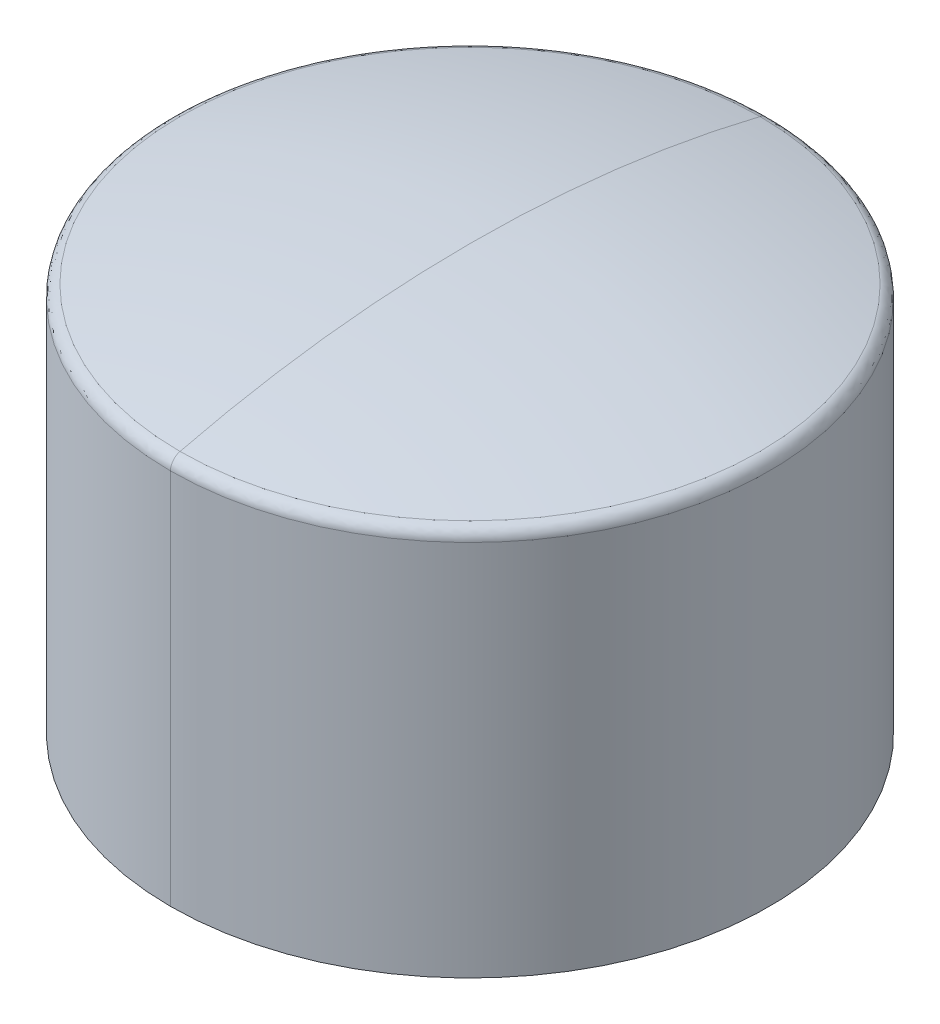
ISO-10303-21;
HEADER;
FILE_DESCRIPTION(('STEP AP214'),'2;1');
FILE_NAME('part.step','',(''),(''),'','','');
FILE_SCHEMA(('AUTOMOTIVE_DESIGN { 1 0 10303 214 1 1 1 1 }'));
ENDSEC;
DATA;
#1=APPLICATION_CONTEXT('core data for automotive mechanical design processes');
#2=APPLICATION_PROTOCOL_DEFINITION('international standard','automotive_design',2000,#1);
#3=PRODUCT_CONTEXT('',#1,'mechanical');
#4=PRODUCT('Part','Part','',(#3));
#5=PRODUCT_RELATED_PRODUCT_CATEGORY('part','',(#4));
#6=PRODUCT_DEFINITION_FORMATION('','',#4);
#7=PRODUCT_DEFINITION_CONTEXT('part definition',#1,'design');
#8=PRODUCT_DEFINITION('design','',#6,#7);
#9=PRODUCT_DEFINITION_SHAPE('','',#8);
#10=(LENGTH_UNIT() NAMED_UNIT(*) SI_UNIT(.MILLI.,.METRE.));
#11=(NAMED_UNIT(*) PLANE_ANGLE_UNIT() SI_UNIT($,.RADIAN.));
#12=(NAMED_UNIT(*) SI_UNIT($,.STERADIAN.) SOLID_ANGLE_UNIT());
#13=UNCERTAINTY_MEASURE_WITH_UNIT(LENGTH_MEASURE(1.E-05),#10,'distance_accuracy_value','');
#14=(GEOMETRIC_REPRESENTATION_CONTEXT(3) GLOBAL_UNCERTAINTY_ASSIGNED_CONTEXT((#13)) GLOBAL_UNIT_ASSIGNED_CONTEXT((#10,
#11,#12)) REPRESENTATION_CONTEXT('',''));
#15=CARTESIAN_POINT('',(0.,0.,0.));
#16=DIRECTION('',(0.,0.,1.));
#17=DIRECTION('',(1.,0.,0.));
#18=AXIS2_PLACEMENT_3D('',#15,#16,#17);
#19=CARTESIAN_POINT('',(0.,8.059580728,-0.502497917));
#20=CARTESIAN_POINT('',(-23.995004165,8.059580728,-0.502497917));
#21=CARTESIAN_POINT('',(-23.995004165,8.059580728,-24.497502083));
#22=CARTESIAN_POINT('',(0.,8.059580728,-24.497502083));
#23=CARTESIAN_POINT('',(0.,8.341701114,-0.474191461));
#24=CARTESIAN_POINT('',(-24.051617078,8.341701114,-0.474191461));
#25=CARTESIAN_POINT('',(-24.051617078,8.341701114,-24.525808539));
#26=CARTESIAN_POINT('',(0.,8.341701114,-24.525808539));
#27=CARTESIAN_POINT('',(0.,8.564808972,-0.64916589));
#28=CARTESIAN_POINT('',(-23.70166822,8.564808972,-0.64916589));
#29=CARTESIAN_POINT('',(-23.70166822,8.564808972,-24.35083411));
#30=CARTESIAN_POINT('',(0.,8.564808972,-24.35083411));
#31=CARTESIAN_POINT('',(0.,8.604559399,-0.929902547));
#32=CARTESIAN_POINT('',(-23.140194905,8.604559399,-0.929902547));
#33=CARTESIAN_POINT('',(-23.140194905,8.604559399,-24.070097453));
#34=CARTESIAN_POINT('',(0.,8.604559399,-24.070097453));
#35=(BOUNDED_SURFACE() B_SPLINE_SURFACE(3,3,((#19,#20,#21,#22),(#23,#24,#25,#26),(#27,#28,#29,
#30),(#31,#32,#33,#34)),.UNSPECIFIED.,.F.,.F.,.F.) B_SPLINE_SURFACE_WITH_KNOTS((4,4),(4,4),(0.,
1.),(0.,1.),.UNSPECIFIED.) GEOMETRIC_REPRESENTATION_ITEM() RATIONAL_B_SPLINE_SURFACE(((1.,
0.333333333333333,0.333333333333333,1.),(0.814223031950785,0.271407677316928,0.271407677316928,
0.814223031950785),(0.814223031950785,0.271407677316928,0.271407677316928,0.814223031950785),
(1.,0.333333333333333,0.333333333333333,1.))) REPRESENTATION_ITEM('') SURFACE());
#36=CARTESIAN_POINT('',(0.,8.059580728,-24.497502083));
#37=CARTESIAN_POINT('',(0.,8.341701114,-24.525808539));
#38=CARTESIAN_POINT('',(0.,8.564808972,-24.35083411));
#39=CARTESIAN_POINT('',(0.,8.604559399,-24.070097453));
#40=(BOUNDED_CURVE() B_SPLINE_CURVE(3,(#36,#37,#38,#39),.UNSPECIFIED.,.F.,
.F.) B_SPLINE_CURVE_WITH_KNOTS((4,4),(0.,1.),
.UNSPECIFIED.) CURVE() GEOMETRIC_REPRESENTATION_ITEM() RATIONAL_B_SPLINE_CURVE((1.,
0.814223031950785,0.814223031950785,1.)) REPRESENTATION_ITEM(''));
#41=CARTESIAN_POINT('',(0.,8.59508808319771,-24.1191709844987));
#42=VERTEX_POINT('',#41);
#43=CARTESIAN_POINT('',(-3.69186171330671E-09,8.10949743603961,-24.5000000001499));
#44=VERTEX_POINT('',#43);
#45=EDGE_CURVE('E35',#42,#44,#40,.F.);
#46=CARTESIAN_POINT('',(0.,8.109497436,-12.5));
#47=DIRECTION('',(0.,1.,0.));
#48=DIRECTION('',(0.,0.,1.));
#49=AXIS2_PLACEMENT_3D('',#46,#47,#48);
#50=CIRCLE('',#49,12.);
#51=CARTESIAN_POINT('',(-5.38761770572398E-10,8.10949743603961,-0.499999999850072));
#52=VERTEX_POINT('',#51);
#53=EDGE_CURVE('E70',#44,#52,#50,.T.);
#54=CARTESIAN_POINT('',(0.,8.059580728,-0.502497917));
#55=CARTESIAN_POINT('',(0.,8.341701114,-0.474191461));
#56=CARTESIAN_POINT('',(0.,8.564808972,-0.64916589));
#57=CARTESIAN_POINT('',(0.,8.604559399,-0.929902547));
#58=(BOUNDED_CURVE() B_SPLINE_CURVE(3,(#54,#55,#56,#57),.UNSPECIFIED.,.F.,
.F.) B_SPLINE_CURVE_WITH_KNOTS((4,4),(0.,1.),
.UNSPECIFIED.) CURVE() GEOMETRIC_REPRESENTATION_ITEM() RATIONAL_B_SPLINE_CURVE((1.,
0.814223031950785,0.814223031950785,1.)) REPRESENTATION_ITEM(''));
#59=CARTESIAN_POINT('',(1.19159263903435E-09,8.59508804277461,-0.880828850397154));
#60=VERTEX_POINT('',#59);
#61=EDGE_CURVE('E190',#52,#60,#58,.T.);
#62=CARTESIAN_POINT('',(0.,8.59508796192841,-12.5));
#63=DIRECTION('',(0.,1.,0.));
#64=DIRECTION('',(0.,0.,-1.));
#65=AXIS2_PLACEMENT_3D('',#62,#63,#64);
#66=CIRCLE('',#65,11.6191714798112);
#67=EDGE_CURVE('E63',#60,#42,#66,.F.);
#68=ORIENTED_EDGE('',*,*,#45,.T.);
#69=ORIENTED_EDGE('',*,*,#53,.T.);
#70=ORIENTED_EDGE('',*,*,#61,.T.);
#71=ORIENTED_EDGE('',*,*,#67,.T.);
#72=EDGE_LOOP('',(#68,#69,#70,#71));
#73=FACE_BOUND('',#72,.T.);
#74=ADVANCED_FACE('F16',(#73),#35,.T.);
#75=CARTESIAN_POINT('',(0.,-38.75,-12.5));
#76=DIRECTION('',(0.,1.,0.));
#77=DIRECTION('',(0.,0.,1.));
#78=AXIS2_PLACEMENT_3D('',#75,#76,#77);
#79=SPHERICAL_SURFACE('',#78,48.75);
#80=CARTESIAN_POINT('',(0.,-38.75,-12.5));
#81=DIRECTION('',(-1.,0.,4.1021390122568E-10));
#82=DIRECTION('',(0.,-1.,0.));
#83=AXIS2_PLACEMENT_3D('',#80,#81,#82);
#84=CIRCLE('',#83,48.75);
#85=CARTESIAN_POINT('',(0.,9.99999999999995,-12.5));
#86=VERTEX_POINT('',#85);
#87=EDGE_CURVE('E58',#60,#86,#84,.T.);
#88=ORIENTED_EDGE('',*,*,#87,.T.);
#89=CARTESIAN_POINT('',(0.,-38.75,-12.5));
#90=DIRECTION('',(1.,0.,1.79580212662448E-10));
#91=DIRECTION('',(0.,-1.,0.));
#92=AXIS2_PLACEMENT_3D('',#89,#90,#91);
#93=CIRCLE('',#92,48.75);
#94=EDGE_CURVE('E61',#86,#42,#93,.F.);
#95=ORIENTED_EDGE('',*,*,#94,.T.);
#96=ORIENTED_EDGE('',*,*,#67,.F.);
#97=EDGE_LOOP('',(#88,#95,#96));
#98=FACE_BOUND('',#97,.T.);
#99=ADVANCED_FACE('F60',(#98),#79,.T.);
#100=CARTESIAN_POINT('',(0.,-7.,-12.5));
#101=DIRECTION('',(0.,1.,0.));
#102=DIRECTION('',(-1.,0.,0.));
#103=AXIS2_PLACEMENT_3D('',#100,#101,#102);
#104=CYLINDRICAL_SURFACE('',#103,12.);
#105=CARTESIAN_POINT('',(0.,-7.,-12.5));
#106=DIRECTION('',(0.,1.,0.));
#107=DIRECTION('',(-1.,0.,0.));
#108=AXIS2_PLACEMENT_3D('',#105,#106,#107);
#109=CIRCLE('',#108,12.);
#110=CARTESIAN_POINT('',(-1.07752390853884E-09,-7.,-0.5));
#111=VERTEX_POINT('',#110);
#112=CARTESIAN_POINT('',(-4.92248191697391E-09,-7.,-24.5));
#113=VERTEX_POINT('',#112);
#114=EDGE_CURVE('E20',#111,#113,#109,.F.);
#115=ORIENTED_EDGE('',*,*,#114,.F.);
#116=DIRECTION('',(0.,-1.,0.));
#117=VECTOR('',#116,1.);
#118=CARTESIAN_POINT('',(0.,0.554748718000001,-0.5));
#119=LINE('',#118,#117);
#120=EDGE_CURVE('E66',#111,#52,#119,.F.);
#121=ORIENTED_EDGE('',*,*,#120,.T.);
#122=ORIENTED_EDGE('',*,*,#53,.F.);
#123=DIRECTION('',(0.,1.,0.));
#124=VECTOR('',#123,1.);
#125=CARTESIAN_POINT('',(-4.92248228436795E-09,0.554748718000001,-24.5));
#126=LINE('',#125,#124);
#127=EDGE_CURVE('E82',#44,#113,#126,.F.);
#128=ORIENTED_EDGE('',*,*,#127,.T.);
#129=EDGE_LOOP('',(#115,#121,#122,#128));
#130=FACE_BOUND('',#129,.T.);
#131=ADVANCED_FACE('F107',(#130),#104,.T.);
#132=CARTESIAN_POINT('',(-12.144,-7.,-0.356));
#133=DIRECTION('',(0.,-1.,0.));
#134=DIRECTION('',(0.,0.,-1.));
#135=AXIS2_PLACEMENT_3D('',#132,#133,#134);
#136=PLANE('',#135);
#137=CARTESIAN_POINT('',(0.,-7.,-12.5));
#138=DIRECTION('',(0.,1.,0.));
#139=DIRECTION('',(-1.,0.,0.));
#140=AXIS2_PLACEMENT_3D('',#137,#138,#139);
#141=CIRCLE('',#140,12.);
#142=EDGE_CURVE('E78',#113,#111,#141,.F.);
#143=ORIENTED_EDGE('',*,*,#142,.T.);
#144=ORIENTED_EDGE('',*,*,#114,.T.);
#145=EDGE_LOOP('',(#143,#144));
#146=FACE_BOUND('',#145,.T.);
#147=ADVANCED_FACE('F18',(#146),#136,.T.);
#148=CARTESIAN_POINT('',(0.,-38.75,-12.5));
#149=DIRECTION('',(0.,1.,0.));
#150=DIRECTION('',(0.,0.,1.));
#151=AXIS2_PLACEMENT_3D('',#148,#149,#150);
#152=SPHERICAL_SURFACE('',#151,48.75);
#153=CARTESIAN_POINT('',(0.,8.59508808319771,-12.5));
#154=DIRECTION('',(0.,-1.,0.));
#155=DIRECTION('',(1.,0.,0.));
#156=AXIS2_PLACEMENT_3D('',#153,#154,#155);
#157=CIRCLE('',#156,11.6191709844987);
#158=EDGE_CURVE('E26',#42,#60,#157,.T.);
#159=ORIENTED_EDGE('',*,*,#158,.F.);
#160=ORIENTED_EDGE('',*,*,#94,.F.);
#161=ORIENTED_EDGE('',*,*,#87,.F.);
#162=EDGE_LOOP('',(#159,#160,#161));
#163=FACE_BOUND('',#162,.T.);
#164=ADVANCED_FACE('F68',(#163),#152,.T.);
#165=CARTESIAN_POINT('',(0.,-7.,-12.5));
#166=DIRECTION('',(0.,1.,0.));
#167=DIRECTION('',(-1.,0.,0.));
#168=AXIS2_PLACEMENT_3D('',#165,#166,#167);
#169=CYLINDRICAL_SURFACE('',#168,12.);
#170=ORIENTED_EDGE('',*,*,#127,.F.);
#171=CARTESIAN_POINT('',(0.,8.10949743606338,-12.5));
#172=DIRECTION('',(0.,1.,0.));
#173=DIRECTION('',(0.,0.,1.));
#174=AXIS2_PLACEMENT_3D('',#171,#172,#173);
#175=CIRCLE('',#174,12.0000000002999);
#176=EDGE_CURVE('E10',#52,#44,#175,.T.);
#177=ORIENTED_EDGE('',*,*,#176,.F.);
#178=ORIENTED_EDGE('',*,*,#120,.F.);
#179=ORIENTED_EDGE('',*,*,#142,.F.);
#180=EDGE_LOOP('',(#170,#177,#178,#179));
#181=FACE_BOUND('',#180,.T.);
#182=ADVANCED_FACE('F122',(#181),#169,.T.);
#183=CARTESIAN_POINT('',(0.,8.059580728,-24.497502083));
#184=CARTESIAN_POINT('',(23.995004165,8.059580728,-24.497502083));
#185=CARTESIAN_POINT('',(23.995004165,8.059580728,-0.502497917));
#186=CARTESIAN_POINT('',(0.,8.059580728,-0.502497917));
#187=CARTESIAN_POINT('',(0.,8.341701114,-24.525808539));
#188=CARTESIAN_POINT('',(24.051617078,8.341701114,-24.525808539));
#189=CARTESIAN_POINT('',(24.051617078,8.341701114,-0.474191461));
#190=CARTESIAN_POINT('',(0.,8.341701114,-0.474191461));
#191=CARTESIAN_POINT('',(0.,8.564808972,-24.35083411));
#192=CARTESIAN_POINT('',(23.70166822,8.564808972,-24.35083411));
#193=CARTESIAN_POINT('',(23.70166822,8.564808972,-0.64916589));
#194=CARTESIAN_POINT('',(0.,8.564808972,-0.64916589));
#195=CARTESIAN_POINT('',(0.,8.604559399,-24.070097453));
#196=CARTESIAN_POINT('',(23.140194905,8.604559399,-24.070097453));
#197=CARTESIAN_POINT('',(23.140194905,8.604559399,-0.929902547));
#198=CARTESIAN_POINT('',(0.,8.604559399,-0.929902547));
#199=(BOUNDED_SURFACE() B_SPLINE_SURFACE(3,3,((#183,#184,#185,#186),(#187,#188,#189,#190),(#191,
#192,#193,#194),(#195,#196,#197,#198)),.UNSPECIFIED.,.F.,.F.,
.F.) B_SPLINE_SURFACE_WITH_KNOTS((4,4),(4,4),(0.,1.),(0.,1.),
.UNSPECIFIED.) GEOMETRIC_REPRESENTATION_ITEM() RATIONAL_B_SPLINE_SURFACE(((1.,0.333333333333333,
0.333333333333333,1.),(0.814223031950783,0.271407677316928,0.271407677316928,0.814223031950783),
(0.814223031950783,0.271407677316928,0.271407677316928,0.814223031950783),(1.,0.333333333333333,
0.333333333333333,1.))) REPRESENTATION_ITEM('') SURFACE());
#200=ORIENTED_EDGE('',*,*,#176,.T.);
#201=ORIENTED_EDGE('',*,*,#45,.F.);
#202=ORIENTED_EDGE('',*,*,#158,.T.);
#203=ORIENTED_EDGE('',*,*,#61,.F.);
#204=EDGE_LOOP('',(#200,#201,#202,#203));
#205=FACE_BOUND('',#204,.T.);
#206=ADVANCED_FACE('F120',(#205),#199,.T.);
#207=CLOSED_SHELL('',(#74,#99,#131,#147,#164,#182,#206));
#208=MANIFOLD_SOLID_BREP('B1',#207);
#209=ADVANCED_BREP_SHAPE_REPRESENTATION('',(#18,#208),#14);
#210=SHAPE_DEFINITION_REPRESENTATION(#9,#209);
ENDSEC;
END-ISO-10303-21;
